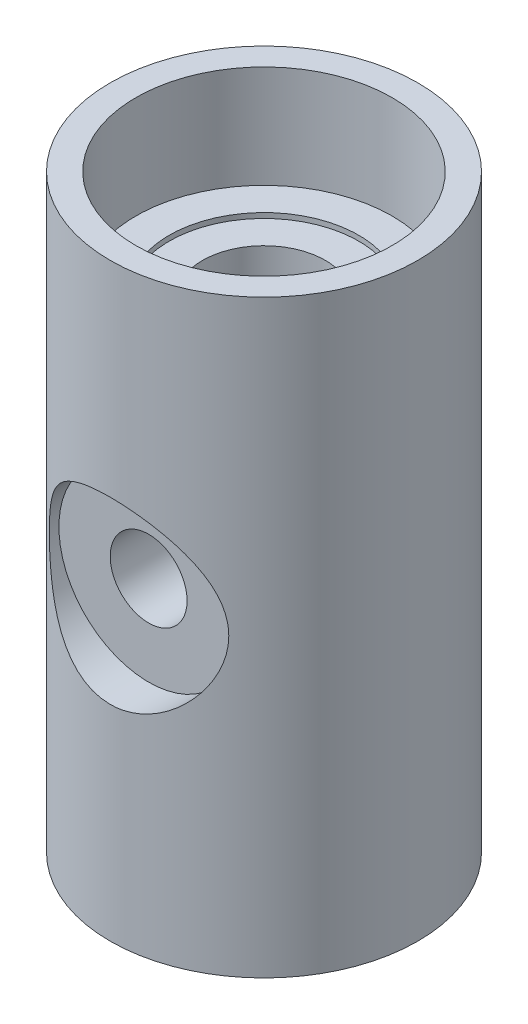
ISO-10303-21;
HEADER;
FILE_DESCRIPTION(('STEP AP214'),'2;1');
FILE_NAME('part.step','',(''),(''),'','','');
FILE_SCHEMA(('AUTOMOTIVE_DESIGN { 1 0 10303 214 1 1 1 1 }'));
ENDSEC;
DATA;
#1=APPLICATION_CONTEXT('core data for automotive mechanical design processes');
#2=APPLICATION_PROTOCOL_DEFINITION('international standard','automotive_design',2000,#1);
#3=PRODUCT_CONTEXT('',#1,'mechanical');
#4=PRODUCT('Part','Part','',(#3));
#5=PRODUCT_RELATED_PRODUCT_CATEGORY('part','',(#4));
#6=PRODUCT_DEFINITION_FORMATION('','',#4);
#7=PRODUCT_DEFINITION_CONTEXT('part definition',#1,'design');
#8=PRODUCT_DEFINITION('design','',#6,#7);
#9=PRODUCT_DEFINITION_SHAPE('','',#8);
#10=(LENGTH_UNIT() NAMED_UNIT(*) SI_UNIT(.MILLI.,.METRE.));
#11=(NAMED_UNIT(*) PLANE_ANGLE_UNIT() SI_UNIT($,.RADIAN.));
#12=(NAMED_UNIT(*) SI_UNIT($,.STERADIAN.) SOLID_ANGLE_UNIT());
#13=UNCERTAINTY_MEASURE_WITH_UNIT(LENGTH_MEASURE(1.E-05),#10,'distance_accuracy_value','');
#14=(GEOMETRIC_REPRESENTATION_CONTEXT(3) GLOBAL_UNCERTAINTY_ASSIGNED_CONTEXT((#13)) GLOBAL_UNIT_ASSIGNED_CONTEXT((#10,
#11,#12)) REPRESENTATION_CONTEXT('',''));
#15=CARTESIAN_POINT('',(0.,0.,0.));
#16=DIRECTION('',(0.,0.,1.));
#17=DIRECTION('',(1.,0.,0.));
#18=AXIS2_PLACEMENT_3D('',#15,#16,#17);
#19=CARTESIAN_POINT('',(0.,0.,0.800000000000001));
#20=DIRECTION('',(0.,0.,1.));
#21=DIRECTION('',(1.,0.,0.));
#22=AXIS2_PLACEMENT_3D('',#19,#20,#21);
#23=CYLINDRICAL_SURFACE('',#22,1.5);
#24=CARTESIAN_POINT('',(0.,-1.5,2.4));
#25=CARTESIAN_POINT('',(0.0762125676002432,-1.49999478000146,2.39999514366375));
#26=CARTESIAN_POINT('',(0.152515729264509,-1.49415238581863,2.39633187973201));
#27=CARTESIAN_POINT('',(0.302781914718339,-1.4710970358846,2.38202601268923));
#28=CARTESIAN_POINT('',(0.376740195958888,-1.45386240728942,2.37137010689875));
#29=CARTESIAN_POINT('',(0.519846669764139,-1.40902636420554,2.34415023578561));
#30=CARTESIAN_POINT('',(0.589016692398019,-1.38147625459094,2.32761552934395));
#31=CARTESIAN_POINT('',(0.721512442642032,-1.3171369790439,2.29001518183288));
#32=CARTESIAN_POINT('',(0.784838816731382,-1.28034883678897,2.26895004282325));
#33=CARTESIAN_POINT('',(0.909569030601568,-1.19533611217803,2.22204183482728));
#34=CARTESIAN_POINT('',(0.970415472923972,-1.14643284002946,2.1959515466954));
#35=CARTESIAN_POINT('',(1.08358365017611,-1.04013699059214,2.14237619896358));
#36=CARTESIAN_POINT('',(1.13589372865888,-0.982733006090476,2.11488929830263));
#37=CARTESIAN_POINT('',(1.23771447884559,-0.851959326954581,2.05716502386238));
#38=CARTESIAN_POINT('',(1.28588647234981,-0.777480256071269,2.02705933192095));
#39=CARTESIAN_POINT('',(1.36888759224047,-0.619722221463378,1.97196237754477));
#40=CARTESIAN_POINT('',(1.40373925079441,-0.536458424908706,1.94696251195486));
#41=CARTESIAN_POINT('',(1.45120080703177,-0.38542737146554,1.91171490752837));
#42=CARTESIAN_POINT('',(1.46723462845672,-0.319239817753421,1.89932287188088));
#43=CARTESIAN_POINT('',(1.49018212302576,-0.184432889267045,1.88137628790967));
#44=CARTESIAN_POINT('',(1.49710867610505,-0.115817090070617,1.87581208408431));
#45=CARTESIAN_POINT('',(1.50142701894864,0.0220956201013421,1.87235862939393));
#46=CARTESIAN_POINT('',(1.49879380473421,0.0913938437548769,1.87448950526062));
#47=CARTESIAN_POINT('',(1.48411580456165,0.228372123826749,1.88612882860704));
#48=CARTESIAN_POINT('',(1.47206347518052,0.296050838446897,1.89564318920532));
#49=CARTESIAN_POINT('',(1.43961724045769,0.426526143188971,1.92039087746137));
#50=CARTESIAN_POINT('',(1.41942020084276,0.489398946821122,1.93548858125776));
#51=CARTESIAN_POINT('',(1.37148227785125,0.610993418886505,1.96974679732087));
#52=CARTESIAN_POINT('',(1.34373872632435,0.669713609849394,1.98890874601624));
#53=CARTESIAN_POINT('',(1.27553871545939,0.792999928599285,2.03345779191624));
#54=CARTESIAN_POINT('',(1.23367555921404,0.856608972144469,2.05933909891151));
#55=CARTESIAN_POINT('',(1.14105775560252,0.976596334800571,2.11206854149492));
#56=CARTESIAN_POINT('',(1.09029396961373,1.03296711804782,2.13891764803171));
#57=CARTESIAN_POINT('',(0.971423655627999,1.14636209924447,2.19575873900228));
#58=CARTESIAN_POINT('',(0.901837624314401,1.2019595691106,2.22553838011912));
#59=CARTESIAN_POINT('',(0.752577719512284,1.3006210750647,2.28033666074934));
#60=CARTESIAN_POINT('',(0.6729078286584,1.34369003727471,2.30535717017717));
#61=CARTESIAN_POINT('',(0.509860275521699,1.41331642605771,2.34664047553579));
#62=CARTESIAN_POINT('',(0.426916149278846,1.44064084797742,2.36330371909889));
#63=CARTESIAN_POINT('',(0.256334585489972,1.48051791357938,2.38781915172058));
#64=CARTESIAN_POINT('',(0.168703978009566,1.4930914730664,2.39568381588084));
#65=CARTESIAN_POINT('',(0.00541874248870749,1.50187902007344,2.40117408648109));
#66=CARTESIAN_POINT('',(-0.0700833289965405,1.50024381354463,2.40014593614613));
#67=CARTESIAN_POINT('',(-0.21956654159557,1.48574060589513,2.39110681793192));
#68=CARTESIAN_POINT('',(-0.293547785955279,1.4728733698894,2.3830963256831));
#69=CARTESIAN_POINT('',(-0.435025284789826,1.43731375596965,2.36128862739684));
#70=CARTESIAN_POINT('',(-0.502662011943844,1.41502541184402,2.34773004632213));
#71=CARTESIAN_POINT('',(-0.633165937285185,1.36164433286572,2.31594820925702));
#72=CARTESIAN_POINT('',(-0.696032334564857,1.33055012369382,2.2977241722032));
#73=CARTESIAN_POINT('',(-0.822100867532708,1.25698175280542,2.255880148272));
#74=CARTESIAN_POINT('',(-0.884696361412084,1.21367571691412,2.23190117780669));
#75=CARTESIAN_POINT('',(-1.00217116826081,1.11864736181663,2.1816836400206));
#76=CARTESIAN_POINT('',(-1.05704178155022,1.06691569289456,2.15544257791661));
#77=CARTESIAN_POINT('',(-1.16576903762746,0.94783795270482,2.0988704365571));
#78=CARTESIAN_POINT('',(-1.21832222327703,0.879315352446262,2.06849860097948));
#79=CARTESIAN_POINT('',(-1.31136422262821,0.733349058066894,2.01080115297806));
#80=CARTESIAN_POINT('',(-1.35186138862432,0.655911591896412,1.98347343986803));
#81=CARTESIAN_POINT('',(-1.41221726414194,0.510369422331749,1.9408023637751));
#82=CARTESIAN_POINT('',(-1.43462275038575,0.443711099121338,1.92414763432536));
#83=CARTESIAN_POINT('',(-1.47000129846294,0.3067282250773,1.89726036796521));
#84=CARTESIAN_POINT('',(-1.48298909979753,0.236409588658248,1.88701779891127));
#85=CARTESIAN_POINT('',(-1.49881660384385,0.0934916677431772,1.87447589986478));
#86=CARTESIAN_POINT('',(-1.50159824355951,0.020881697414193,1.87222202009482));
#87=CARTESIAN_POINT('',(-1.49663734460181,-0.123757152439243,1.87618875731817));
#88=CARTESIAN_POINT('',(-1.48889130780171,-0.195785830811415,1.88241219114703));
#89=CARTESIAN_POINT('',(-1.46445926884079,-0.331235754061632,1.90146466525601));
#90=CARTESIAN_POINT('',(-1.44854303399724,-0.394883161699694,1.91372169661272));
#91=CARTESIAN_POINT('',(-1.40901148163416,-0.518562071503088,1.94301036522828));
#92=CARTESIAN_POINT('',(-1.38539295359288,-0.578592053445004,1.96004399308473));
#93=CARTESIAN_POINT('',(-1.32723228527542,-0.702716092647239,1.99996683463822));
#94=CARTESIAN_POINT('',(-1.29160373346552,-0.766140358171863,2.02334676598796));
#95=CARTESIAN_POINT('',(-1.21200020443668,-0.886726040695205,2.07201247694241));
#96=CARTESIAN_POINT('',(-1.16801847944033,-0.943882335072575,2.0972997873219));
#97=CARTESIAN_POINT('',(-1.06280426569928,-1.06201710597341,2.15282292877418));
#98=CARTESIAN_POINT('',(-0.999880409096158,-1.12150901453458,2.18304650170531));
#99=CARTESIAN_POINT('',(-0.86378693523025,-1.22939379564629,2.24038474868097));
#100=CARTESIAN_POINT('',(-0.790611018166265,-1.27777979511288,2.26749749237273));
#101=CARTESIAN_POINT('',(-0.635226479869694,-1.36172535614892,2.31584053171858));
#102=CARTESIAN_POINT('',(-0.553002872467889,-1.39726320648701,2.33706085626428));
#103=CARTESIAN_POINT('',(-0.382073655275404,-1.45328626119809,2.37097825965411));
#104=CARTESIAN_POINT('',(-0.293392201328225,-1.47382468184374,2.38370545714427));
#105=CARTESIAN_POINT('',(-0.169702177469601,-1.49075905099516,2.39423366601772));
#106=CARTESIAN_POINT('',(-0.135898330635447,-1.49421823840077,2.39639006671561));
#107=CARTESIAN_POINT('',(-0.0680690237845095,-1.49883994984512,2.39927436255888));
#108=CARTESIAN_POINT('',(-0.0340435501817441,-1.50000233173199,2.40000216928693));
#109=CARTESIAN_POINT('',(0.,-1.5,2.4));
#110=B_SPLINE_CURVE_WITH_KNOTS('',3,(#24,#25,#26,#27,#28,#29,#30,#31,#32,#33,#34,#35,#36,#37,
#38,#39,#40,#41,#42,#43,#44,#45,#46,#47,#48,#49,#50,#51,#52,#53,#54,#55,#56,#57,#58,#59,#60,#61,
#62,#63,#64,#65,#66,#67,#68,#69,#70,#71,#72,#73,#74,#75,#76,#77,#78,#79,#80,#81,#82,#83,#84,#85,
#86,#87,#88,#89,#90,#91,#92,#93,#94,#95,#96,#97,#98,#99,#100,#101,#102,#103,#104,#105,#106,#107,
#108,#109),.UNSPECIFIED.,.T.,.F.,(4,2,2,2,2,2,2,2,2,2,2,2,2,2,2,2,2,2,2,2,2,2,2,2,2,2,2,2,2,2,2,
2,2,2,2,2,2,2,2,2,2,2,4),(0.,0.228494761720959,0.457425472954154,0.685232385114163,
0.913014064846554,1.15898624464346,1.40529153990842,1.68495571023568,1.96414469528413,
2.1709441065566,2.37745073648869,2.58449788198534,2.791711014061,2.99419007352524,
3.1967408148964,3.43712940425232,3.67776627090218,3.95810616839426,4.23833568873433,
4.50341008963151,4.76810817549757,4.99352616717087,5.21892880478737,5.43551405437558,
5.6521355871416,5.89062277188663,6.12937642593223,6.40278850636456,6.67601072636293,
6.89195928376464,7.10756912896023,7.32440369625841,7.54131033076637,7.74075802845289,
7.94028896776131,8.16870627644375,8.39730889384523,8.67120646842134,8.945273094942,
9.21980070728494,9.4933495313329,9.59541001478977,9.69747681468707),.UNSPECIFIED.);
#111=CARTESIAN_POINT('',(0.,-1.5,2.4));
#112=VERTEX_POINT('',#111);
#113=EDGE_CURVE('E66',#112,#112,#110,.T.);
#114=ORIENTED_EDGE('',*,*,#113,.F.);
#115=EDGE_LOOP('',(#114));
#116=FACE_BOUND('',#115,.T.);
#117=CARTESIAN_POINT('',(0.,0.,4.5));
#118=DIRECTION('',(0.,0.,1.));
#119=DIRECTION('',(1.,0.,0.));
#120=AXIS2_PLACEMENT_3D('',#117,#118,#119);
#121=CIRCLE('',#120,1.5);
#122=CARTESIAN_POINT('',(1.5,0.,4.5));
#123=VERTEX_POINT('',#122);
#124=EDGE_CURVE('E64',#123,#123,#121,.F.);
#125=ORIENTED_EDGE('',*,*,#124,.F.);
#126=EDGE_LOOP('',(#125));
#127=FACE_BOUND('',#126,.T.);
#128=ADVANCED_FACE('F30',(#116,#127),#23,.F.);
#129=CARTESIAN_POINT('',(0.,-11.5,0.));
#130=DIRECTION('',(0.,1.,0.));
#131=DIRECTION('',(0.,0.,1.));
#132=AXIS2_PLACEMENT_3D('',#129,#130,#131);
#133=CYLINDRICAL_SURFACE('',#132,2.4);
#134=ORIENTED_EDGE('',*,*,#113,.T.);
#135=EDGE_LOOP('',(#134));
#136=FACE_BOUND('',#135,.T.);
#137=CARTESIAN_POINT('',(0.,7.3,0.));
#138=DIRECTION('',(0.,1.,0.));
#139=DIRECTION('',(0.,0.,1.));
#140=AXIS2_PLACEMENT_3D('',#137,#138,#139);
#141=CIRCLE('',#140,2.4);
#142=CARTESIAN_POINT('',(0.,7.3,2.4));
#143=VERTEX_POINT('',#142);
#144=EDGE_CURVE('E56',#143,#143,#141,.F.);
#145=ORIENTED_EDGE('',*,*,#144,.F.);
#146=EDGE_LOOP('',(#145));
#147=FACE_BOUND('',#146,.T.);
#148=CARTESIAN_POINT('',(0.,-7.3,0.));
#149=DIRECTION('',(0.,-1.,0.));
#150=DIRECTION('',(0.,0.,-1.));
#151=AXIS2_PLACEMENT_3D('',#148,#149,#150);
#152=CIRCLE('',#151,2.4);
#153=CARTESIAN_POINT('',(0.,-7.3,-2.4));
#154=VERTEX_POINT('',#153);
#155=EDGE_CURVE('E60',#154,#154,#152,.F.);
#156=ORIENTED_EDGE('',*,*,#155,.F.);
#157=EDGE_LOOP('',(#156));
#158=FACE_BOUND('',#157,.T.);
#159=ADVANCED_FACE('F83',(#136,#147,#158),#133,.F.);
#160=CARTESIAN_POINT('',(0.,-7.5,0.));
#161=DIRECTION('',(0.,-1.,0.));
#162=DIRECTION('',(0.,0.,1.));
#163=AXIS2_PLACEMENT_3D('',#160,#161,#162);
#164=PLANE('',#163);
#165=CARTESIAN_POINT('',(0.,-7.5,0.));
#166=DIRECTION('',(0.,1.,0.));
#167=DIRECTION('',(0.,0.,1.));
#168=AXIS2_PLACEMENT_3D('',#165,#166,#167);
#169=CIRCLE('',#168,5.);
#170=CARTESIAN_POINT('',(0.,-7.5,5.));
#171=VERTEX_POINT('',#170);
#172=EDGE_CURVE('E139',#171,#171,#169,.T.);
#173=ORIENTED_EDGE('',*,*,#172,.F.);
#174=EDGE_LOOP('',(#173));
#175=FACE_BOUND('',#174,.T.);
#176=CARTESIAN_POINT('',(0.,-7.5,0.));
#177=DIRECTION('',(0.,1.,0.));
#178=DIRECTION('',(0.,0.,1.));
#179=AXIS2_PLACEMENT_3D('',#176,#177,#178);
#180=CIRCLE('',#179,3.7);
#181=CARTESIAN_POINT('',(0.,-7.5,3.7));
#182=VERTEX_POINT('',#181);
#183=EDGE_CURVE('E71',#182,#182,#180,.T.);
#184=ORIENTED_EDGE('',*,*,#183,.T.);
#185=EDGE_LOOP('',(#184));
#186=FACE_BOUND('',#185,.T.);
#187=ADVANCED_FACE('F103',(#175,#186),#164,.T.);
#188=CARTESIAN_POINT('',(0.,-11.5,0.));
#189=DIRECTION('',(0.,1.,0.));
#190=DIRECTION('',(0.,0.,1.));
#191=AXIS2_PLACEMENT_3D('',#188,#189,#190);
#192=PLANE('',#191);
#193=CARTESIAN_POINT('',(0.,-11.5,0.));
#194=DIRECTION('',(0.,1.,0.));
#195=DIRECTION('',(0.,0.,1.));
#196=AXIS2_PLACEMENT_3D('',#193,#194,#195);
#197=CIRCLE('',#196,6.);
#198=CARTESIAN_POINT('',(0.,-11.5,6.));
#199=VERTEX_POINT('',#198);
#200=EDGE_CURVE('E45',#199,#199,#197,.T.);
#201=ORIENTED_EDGE('',*,*,#200,.F.);
#202=EDGE_LOOP('',(#201));
#203=FACE_BOUND('',#202,.T.);
#204=CARTESIAN_POINT('',(0.,-11.5,0.));
#205=DIRECTION('',(0.,1.,0.));
#206=DIRECTION('',(0.,0.,1.));
#207=AXIS2_PLACEMENT_3D('',#204,#205,#206);
#208=CIRCLE('',#207,5.);
#209=CARTESIAN_POINT('',(0.,-11.5,5.));
#210=VERTEX_POINT('',#209);
#211=EDGE_CURVE('E62',#210,#210,#208,.T.);
#212=ORIENTED_EDGE('',*,*,#211,.T.);
#213=EDGE_LOOP('',(#212));
#214=FACE_BOUND('',#213,.T.);
#215=ADVANCED_FACE('F106',(#203,#214),#192,.F.);
#216=CARTESIAN_POINT('',(0.,11.5,0.));
#217=DIRECTION('',(0.,-1.,0.));
#218=DIRECTION('',(0.,0.,-1.));
#219=AXIS2_PLACEMENT_3D('',#216,#217,#218);
#220=CYLINDRICAL_SURFACE('',#219,6.);
#221=CARTESIAN_POINT('',(3.5,0.,4.87339717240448));
#222=CARTESIAN_POINT('',(3.50000093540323,-0.177277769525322,4.87339641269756));
#223=CARTESIAN_POINT('',(3.48644793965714,-0.354552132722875,4.88321573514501));
#224=CARTESIAN_POINT('',(3.43317065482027,-0.703218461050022,4.9208078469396));
#225=CARTESIAN_POINT('',(3.39341938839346,-0.874604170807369,4.94859914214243));
#226=CARTESIAN_POINT('',(3.29030409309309,-1.20574223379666,5.01773625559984));
#227=CARTESIAN_POINT('',(3.22710003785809,-1.36556483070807,5.05899002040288));
#228=CARTESIAN_POINT('',(3.07937386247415,-1.67226119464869,5.1502404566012));
#229=CARTESIAN_POINT('',(2.99484491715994,-1.81913079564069,5.20023992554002));
#230=CARTESIAN_POINT('',(2.79556649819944,-2.11425376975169,5.31029228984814));
#231=CARTESIAN_POINT('',(2.67846102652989,-2.2607283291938,5.3708402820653));
#232=CARTESIAN_POINT('',(2.42208832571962,-2.53347611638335,5.49122196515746));
#233=CARTESIAN_POINT('',(2.28280589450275,-2.65973536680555,5.55105513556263));
#234=CARTESIAN_POINT('',(2.05148630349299,-2.83763163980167,5.63907450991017));
#235=CARTESIAN_POINT('',(1.96633387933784,-2.89731089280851,5.66940255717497));
#236=CARTESIAN_POINT('',(1.79041458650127,-3.00919746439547,5.72738826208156));
#237=CARTESIAN_POINT('',(1.69965023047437,-3.06140809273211,5.75504710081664));
#238=CARTESIAN_POINT('',(1.51302950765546,-3.15781122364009,5.80690294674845));
#239=CARTESIAN_POINT('',(1.41717390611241,-3.20200492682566,5.83110047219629));
#240=CARTESIAN_POINT('',(1.22107302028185,-3.28179435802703,5.87529321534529));
#241=CARTESIAN_POINT('',(1.12083060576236,-3.31739561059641,5.89529113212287));
#242=CARTESIAN_POINT('',(0.926016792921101,-3.37666962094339,5.92885804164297));
#243=CARTESIAN_POINT('',(0.831757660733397,-3.40113228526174,5.94284606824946));
#244=CARTESIAN_POINT('',(0.641044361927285,-3.44217497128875,5.96642990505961));
#245=CARTESIAN_POINT('',(0.544591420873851,-3.45875928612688,5.97602810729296));
#246=CARTESIAN_POINT('',(0.350333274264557,-3.48379858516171,5.99055493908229));
#247=CARTESIAN_POINT('',(0.252528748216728,-3.49225751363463,5.99548583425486));
#248=CARTESIAN_POINT('',(0.0564358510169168,-3.50092065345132,6.0005360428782));
#249=CARTESIAN_POINT('',(-0.0418524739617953,-3.50112563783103,6.00065580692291));
#250=CARTESIAN_POINT('',(-0.226429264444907,-3.49374095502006,5.99635041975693));
#251=CARTESIAN_POINT('',(-0.312767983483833,-3.48706623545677,5.99245875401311));
#252=CARTESIAN_POINT('',(-0.484485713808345,-3.46738460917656,5.98102806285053));
#253=CARTESIAN_POINT('',(-0.569864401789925,-3.45437563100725,5.97348784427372));
#254=CARTESIAN_POINT('',(-0.823592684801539,-3.40606182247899,5.94563085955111));
#255=CARTESIAN_POINT('',(-0.989708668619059,-3.36146277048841,5.92007321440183));
#256=CARTESIAN_POINT('',(-1.31275590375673,-3.24903340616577,5.85696630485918));
#257=CARTESIAN_POINT('',(-1.46960684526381,-3.18102735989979,5.81932647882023));
#258=CARTESIAN_POINT('',(-1.76992855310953,-3.02424543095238,5.73512765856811));
#259=CARTESIAN_POINT('',(-1.9133955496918,-2.93546372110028,5.68856616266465));
#260=CARTESIAN_POINT('',(-2.20064206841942,-2.7280222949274,5.58418743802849));
#261=CARTESIAN_POINT('',(-2.34253411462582,-2.60709328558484,5.52569117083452));
#262=CARTESIAN_POINT('',(-2.60519777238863,-2.34466895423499,5.40682680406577));
#263=CARTESIAN_POINT('',(-2.72594205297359,-2.20314744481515,5.34645639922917));
#264=CARTESIAN_POINT('',(-2.95579694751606,-1.88564649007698,5.22321767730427));
#265=CARTESIAN_POINT('',(-3.06230599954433,-1.70760325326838,5.16076614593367));
#266=CARTESIAN_POINT('',(-3.24322331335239,-1.33218303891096,5.04904774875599));
#267=CARTESIAN_POINT('',(-3.31768964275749,-1.13484183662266,4.99975709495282));
#268=CARTESIAN_POINT('',(-3.4170744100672,-0.774468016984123,4.93217164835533));
#269=CARTESIAN_POINT('',(-3.4495501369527,-0.614376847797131,4.9093009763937));
#270=CARTESIAN_POINT('',(-3.49180426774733,-0.289835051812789,4.8793454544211));
#271=CARTESIAN_POINT('',(-3.50160627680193,-0.125389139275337,4.87224418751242));
#272=CARTESIAN_POINT('',(-3.49796077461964,0.203242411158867,4.87486107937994));
#273=CARTESIAN_POINT('',(-3.48449247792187,0.367427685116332,4.88459427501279));
#274=CARTESIAN_POINT('',(-3.43506780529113,0.690724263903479,4.91947046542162));
#275=CARTESIAN_POINT('',(-3.39909443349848,0.849831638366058,4.94462510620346));
#276=CARTESIAN_POINT('',(-3.30605842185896,1.16037405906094,5.00730560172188));
#277=CARTESIAN_POINT('',(-3.24884499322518,1.31174522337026,5.04491969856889));
#278=CARTESIAN_POINT('',(-3.11531442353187,1.60329764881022,5.12845117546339));
#279=CARTESIAN_POINT('',(-3.03898973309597,1.74347445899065,5.17437183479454));
#280=CARTESIAN_POINT('',(-2.85419501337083,2.03423875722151,5.27888825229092));
#281=CARTESIAN_POINT('',(-2.74245197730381,2.18245699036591,5.3383045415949));
#282=CARTESIAN_POINT('',(-2.49705487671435,2.45947881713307,5.45741535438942));
#283=CARTESIAN_POINT('',(-2.36338142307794,2.58826503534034,5.51711007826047));
#284=CARTESIAN_POINT('',(-2.05974314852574,2.8372649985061,5.63798921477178));
#285=CARTESIAN_POINT('',(-1.88739139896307,2.95490844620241,5.69859334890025));
#286=CARTESIAN_POINT('',(-1.61316991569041,3.1078416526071,5.77986541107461));
#287=CARTESIAN_POINT('',(-1.51911093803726,3.15490991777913,5.80535774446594));
#288=CARTESIAN_POINT('',(-1.3263294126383,3.24067209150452,5.85240658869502));
#289=CARTESIAN_POINT('',(-1.22760983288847,3.27937124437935,5.87396556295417));
#290=CARTESIAN_POINT('',(-1.03411285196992,3.34517993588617,5.91096859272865));
#291=CARTESIAN_POINT('',(-0.939628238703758,3.37295785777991,5.92675836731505));
#292=CARTESIAN_POINT('',(-0.748099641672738,3.42053716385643,5.95396444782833));
#293=CARTESIAN_POINT('',(-0.651057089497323,3.44034291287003,5.96538314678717));
#294=CARTESIAN_POINT('',(-0.45526451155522,3.47167940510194,5.983510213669));
#295=CARTESIAN_POINT('',(-0.356515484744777,3.48321483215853,5.99022124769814));
#296=CARTESIAN_POINT('',(-0.1581886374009,3.49783664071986,5.99873532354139));
#297=CARTESIAN_POINT('',(-0.0586109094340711,3.5009239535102,6.00053890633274));
#298=CARTESIAN_POINT('',(0.128080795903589,3.49874218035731,5.99926633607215));
#299=CARTESIAN_POINT('',(0.215211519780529,3.49446035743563,5.99676668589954));
#300=CARTESIAN_POINT('',(0.388733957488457,3.47943739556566,5.98802575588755));
#301=CARTESIAN_POINT('',(0.475125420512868,3.46869414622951,5.98178325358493));
#302=CARTESIAN_POINT('',(0.732176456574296,3.42694664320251,5.95763431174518));
#303=CARTESIAN_POINT('',(0.900898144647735,3.38642210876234,5.93430474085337));
#304=CARTESIAN_POINT('',(1.22754952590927,3.28213924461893,5.87542473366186));
#305=CARTESIAN_POINT('',(1.38553112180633,3.21850373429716,5.83993895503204));
#306=CARTESIAN_POINT('',(1.68873020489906,3.0702892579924,5.75958333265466));
#307=CARTESIAN_POINT('',(1.83394447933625,2.98570504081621,5.71471113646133));
#308=CARTESIAN_POINT('',(2.12460251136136,2.78753012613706,5.61357922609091));
#309=CARTESIAN_POINT('',(2.26832013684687,2.67177406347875,5.55661011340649));
#310=CARTESIAN_POINT('',(2.5354448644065,2.41977205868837,5.43992761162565));
#311=CARTESIAN_POINT('',(2.65882769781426,2.28350199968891,5.38021105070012));
#312=CARTESIAN_POINT('',(2.89610435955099,1.97597820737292,5.2566556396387));
#313=CARTESIAN_POINT('',(3.00730729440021,1.80250671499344,5.19312435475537));
#314=CARTESIAN_POINT('',(3.19864331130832,1.43573005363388,5.07752201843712));
#315=CARTESIAN_POINT('',(3.27881457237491,1.24244962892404,5.0254369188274));
#316=CARTESIAN_POINT('',(3.3932696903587,0.87524079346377,4.94870191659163));
#317=CARTESIAN_POINT('',(3.43307983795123,0.703715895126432,4.92087121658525));
#318=CARTESIAN_POINT('',(3.48642673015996,0.354787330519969,4.88323142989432));
#319=CARTESIAN_POINT('',(3.49999906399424,0.177391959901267,4.87339793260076));
#320=CARTESIAN_POINT('',(3.5,0.,4.87339717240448));
#321=B_SPLINE_CURVE_WITH_KNOTS('',3,(#221,#222,#223,#224,#225,#226,#227,#228,#229,#230,#231,
#232,#233,#234,#235,#236,#237,#238,#239,#240,#241,#242,#243,#244,#245,#246,#247,#248,#249,#250,
#251,#252,#253,#254,#255,#256,#257,#258,#259,#260,#261,#262,#263,#264,#265,#266,#267,#268,#269,
#270,#271,#272,#273,#274,#275,#276,#277,#278,#279,#280,#281,#282,#283,#284,#285,#286,#287,#288,
#289,#290,#291,#292,#293,#294,#295,#296,#297,#298,#299,#300,#301,#302,#303,#304,#305,#306,#307,
#308,#309,#310,#311,#312,#313,#314,#315,#316,#317,#318,#319,#320),.UNSPECIFIED.,.T.,.F.,(4,2,2,
2,2,2,2,2,2,2,2,2,2,2,2,2,2,2,2,2,2,2,2,2,2,2,2,2,2,2,2,2,2,2,2,2,2,2,2,2,2,2,2,2,2,2,2,2,2,4),
(0.,0.531090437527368,1.06272861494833,1.59080517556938,2.1190509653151,2.70797318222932,
3.29730085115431,3.62188124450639,3.94631734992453,4.27070482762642,4.59488318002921,
4.88960721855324,5.18417046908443,5.4785906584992,5.77298327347,6.03271231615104,
6.29252635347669,6.81163795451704,7.33473514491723,7.85797923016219,8.44181220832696,
9.02639424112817,9.67312565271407,10.3186800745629,10.8113676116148,11.3035419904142,
11.7961562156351,12.2891429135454,12.7856985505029,13.2824506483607,13.8648133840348,
14.4476938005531,15.0957740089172,15.4200443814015,15.7441109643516,16.0429097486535,
16.3415447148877,16.6400104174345,16.9384432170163,17.1999277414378,17.461497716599,
17.9840884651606,18.5039416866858,19.023925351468,19.6010134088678,20.1787852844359,
20.822510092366,21.4654403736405,21.9975952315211,22.5290277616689),.UNSPECIFIED.);
#322=CARTESIAN_POINT('',(3.5,0.,4.87339717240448));
#323=VERTEX_POINT('',#322);
#324=EDGE_CURVE('E10',#323,#323,#321,.T.);
#325=ORIENTED_EDGE('',*,*,#324,.T.);
#326=EDGE_LOOP('',(#325));
#327=FACE_BOUND('',#326,.T.);
#328=CARTESIAN_POINT('',(0.,11.5,0.));
#329=DIRECTION('',(0.,1.,0.));
#330=DIRECTION('',(0.,0.,1.));
#331=AXIS2_PLACEMENT_3D('',#328,#329,#330);
#332=CIRCLE('',#331,6.);
#333=CARTESIAN_POINT('',(0.,11.5,6.));
#334=VERTEX_POINT('',#333);
#335=EDGE_CURVE('E41',#334,#334,#332,.T.);
#336=ORIENTED_EDGE('',*,*,#335,.F.);
#337=EDGE_LOOP('',(#336));
#338=FACE_BOUND('',#337,.T.);
#339=ORIENTED_EDGE('',*,*,#200,.T.);
#340=EDGE_LOOP('',(#339));
#341=FACE_BOUND('',#340,.T.);
#342=ADVANCED_FACE('F32',(#327,#338,#341),#220,.T.);
#343=CARTESIAN_POINT('',(0.,11.5,0.));
#344=DIRECTION('',(0.,1.,0.));
#345=DIRECTION('',(0.,0.,1.));
#346=AXIS2_PLACEMENT_3D('',#343,#344,#345);
#347=PLANE('',#346);
#348=CARTESIAN_POINT('',(0.,11.5,0.));
#349=DIRECTION('',(0.,1.,0.));
#350=DIRECTION('',(0.,0.,1.));
#351=AXIS2_PLACEMENT_3D('',#348,#349,#350);
#352=CIRCLE('',#351,5.);
#353=CARTESIAN_POINT('',(0.,11.5,5.));
#354=VERTEX_POINT('',#353);
#355=EDGE_CURVE('E53',#354,#354,#352,.T.);
#356=ORIENTED_EDGE('',*,*,#355,.F.);
#357=EDGE_LOOP('',(#356));
#358=FACE_BOUND('',#357,.T.);
#359=ORIENTED_EDGE('',*,*,#335,.T.);
#360=EDGE_LOOP('',(#359));
#361=FACE_BOUND('',#360,.T.);
#362=ADVANCED_FACE('F122',(#358,#361),#347,.T.);
#363=CARTESIAN_POINT('',(0.,7.5,0.));
#364=DIRECTION('',(0.,1.,0.));
#365=DIRECTION('',(0.,0.,1.));
#366=AXIS2_PLACEMENT_3D('',#363,#364,#365);
#367=PLANE('',#366);
#368=CARTESIAN_POINT('',(0.,7.5,0.));
#369=DIRECTION('',(0.,1.,0.));
#370=DIRECTION('',(0.,0.,1.));
#371=AXIS2_PLACEMENT_3D('',#368,#369,#370);
#372=CIRCLE('',#371,3.7);
#373=CARTESIAN_POINT('',(0.,7.5,3.7));
#374=VERTEX_POINT('',#373);
#375=EDGE_CURVE('E136',#374,#374,#372,.T.);
#376=ORIENTED_EDGE('',*,*,#375,.F.);
#377=EDGE_LOOP('',(#376));
#378=FACE_BOUND('',#377,.T.);
#379=CARTESIAN_POINT('',(0.,7.5,0.));
#380=DIRECTION('',(0.,1.,0.));
#381=DIRECTION('',(0.,0.,1.));
#382=AXIS2_PLACEMENT_3D('',#379,#380,#381);
#383=CIRCLE('',#382,5.);
#384=CARTESIAN_POINT('',(0.,7.5,5.));
#385=VERTEX_POINT('',#384);
#386=EDGE_CURVE('E50',#385,#385,#383,.T.);
#387=ORIENTED_EDGE('',*,*,#386,.T.);
#388=EDGE_LOOP('',(#387));
#389=FACE_BOUND('',#388,.T.);
#390=ADVANCED_FACE('F120',(#378,#389),#367,.T.);
#391=CARTESIAN_POINT('',(0.,7.5,0.));
#392=DIRECTION('',(0.,1.,0.));
#393=DIRECTION('',(0.,0.,1.));
#394=AXIS2_PLACEMENT_3D('',#391,#392,#393);
#395=CYLINDRICAL_SURFACE('',#394,5.);
#396=ORIENTED_EDGE('',*,*,#386,.F.);
#397=EDGE_LOOP('',(#396));
#398=FACE_BOUND('',#397,.T.);
#399=ORIENTED_EDGE('',*,*,#355,.T.);
#400=EDGE_LOOP('',(#399));
#401=FACE_BOUND('',#400,.T.);
#402=ADVANCED_FACE('F115',(#398,#401),#395,.F.);
#403=CARTESIAN_POINT('',(0.,7.3,0.));
#404=DIRECTION('',(0.,1.,0.));
#405=DIRECTION('',(0.,0.,1.));
#406=AXIS2_PLACEMENT_3D('',#403,#404,#405);
#407=PLANE('',#406);
#408=CARTESIAN_POINT('',(0.,7.3,0.));
#409=DIRECTION('',(0.,1.,0.));
#410=DIRECTION('',(0.,0.,1.));
#411=AXIS2_PLACEMENT_3D('',#408,#409,#410);
#412=CIRCLE('',#411,3.7);
#413=CARTESIAN_POINT('',(0.,7.3,3.7));
#414=VERTEX_POINT('',#413);
#415=EDGE_CURVE('E59',#414,#414,#412,.T.);
#416=ORIENTED_EDGE('',*,*,#415,.T.);
#417=EDGE_LOOP('',(#416));
#418=FACE_BOUND('',#417,.T.);
#419=ORIENTED_EDGE('',*,*,#144,.T.);
#420=EDGE_LOOP('',(#419));
#421=FACE_BOUND('',#420,.T.);
#422=ADVANCED_FACE('F112',(#418,#421),#407,.T.);
#423=CARTESIAN_POINT('',(0.,7.3,0.));
#424=DIRECTION('',(0.,1.,0.));
#425=DIRECTION('',(0.,0.,1.));
#426=AXIS2_PLACEMENT_3D('',#423,#424,#425);
#427=CYLINDRICAL_SURFACE('',#426,3.7);
#428=ORIENTED_EDGE('',*,*,#415,.F.);
#429=EDGE_LOOP('',(#428));
#430=FACE_BOUND('',#429,.T.);
#431=ORIENTED_EDGE('',*,*,#375,.T.);
#432=EDGE_LOOP('',(#431));
#433=FACE_BOUND('',#432,.T.);
#434=ADVANCED_FACE('F110',(#430,#433),#427,.F.);
#435=CARTESIAN_POINT('',(0.,-7.5,0.));
#436=DIRECTION('',(0.,-1.,0.));
#437=DIRECTION('',(0.,0.,-1.));
#438=AXIS2_PLACEMENT_3D('',#435,#436,#437);
#439=CYLINDRICAL_SURFACE('',#438,5.);
#440=ORIENTED_EDGE('',*,*,#172,.T.);
#441=EDGE_LOOP('',(#440));
#442=FACE_BOUND('',#441,.T.);
#443=ORIENTED_EDGE('',*,*,#211,.F.);
#444=EDGE_LOOP('',(#443));
#445=FACE_BOUND('',#444,.T.);
#446=ADVANCED_FACE('F98',(#442,#445),#439,.F.);
#447=CARTESIAN_POINT('',(0.,-7.3,0.));
#448=DIRECTION('',(0.,-1.,0.));
#449=DIRECTION('',(0.,0.,1.));
#450=AXIS2_PLACEMENT_3D('',#447,#448,#449);
#451=PLANE('',#450);
#452=CARTESIAN_POINT('',(0.,-7.3,0.));
#453=DIRECTION('',(0.,1.,0.));
#454=DIRECTION('',(0.,0.,1.));
#455=AXIS2_PLACEMENT_3D('',#452,#453,#454);
#456=CIRCLE('',#455,3.7);
#457=CARTESIAN_POINT('',(0.,-7.3,3.7));
#458=VERTEX_POINT('',#457);
#459=EDGE_CURVE('E63',#458,#458,#456,.T.);
#460=ORIENTED_EDGE('',*,*,#459,.F.);
#461=EDGE_LOOP('',(#460));
#462=FACE_BOUND('',#461,.T.);
#463=ORIENTED_EDGE('',*,*,#155,.T.);
#464=EDGE_LOOP('',(#463));
#465=FACE_BOUND('',#464,.T.);
#466=ADVANCED_FACE('F94',(#462,#465),#451,.T.);
#467=CARTESIAN_POINT('',(0.,-7.3,0.));
#468=DIRECTION('',(0.,-1.,0.));
#469=DIRECTION('',(0.,0.,-1.));
#470=AXIS2_PLACEMENT_3D('',#467,#468,#469);
#471=CYLINDRICAL_SURFACE('',#470,3.7);
#472=ORIENTED_EDGE('',*,*,#459,.T.);
#473=EDGE_LOOP('',(#472));
#474=FACE_BOUND('',#473,.T.);
#475=ORIENTED_EDGE('',*,*,#183,.F.);
#476=EDGE_LOOP('',(#475));
#477=FACE_BOUND('',#476,.T.);
#478=ADVANCED_FACE('F97',(#474,#477),#471,.F.);
#479=CARTESIAN_POINT('',(0.,0.,4.5));
#480=DIRECTION('',(0.,0.,1.));
#481=DIRECTION('',(1.,0.,0.));
#482=AXIS2_PLACEMENT_3D('',#479,#480,#481);
#483=CYLINDRICAL_SURFACE('',#482,3.5);
#484=CARTESIAN_POINT('',(0.,0.,4.5));
#485=DIRECTION('',(0.,0.,1.));
#486=DIRECTION('',(1.,0.,0.));
#487=AXIS2_PLACEMENT_3D('',#484,#485,#486);
#488=CIRCLE('',#487,3.5);
#489=CARTESIAN_POINT('',(3.5,0.,4.5));
#490=VERTEX_POINT('',#489);
#491=EDGE_CURVE('E67',#490,#490,#488,.T.);
#492=ORIENTED_EDGE('',*,*,#491,.F.);
#493=EDGE_LOOP('',(#492));
#494=FACE_BOUND('',#493,.T.);
#495=ORIENTED_EDGE('',*,*,#324,.F.);
#496=EDGE_LOOP('',(#495));
#497=FACE_BOUND('',#496,.T.);
#498=ADVANCED_FACE('F91',(#494,#497),#483,.F.);
#499=CARTESIAN_POINT('',(0.,0.,4.5));
#500=DIRECTION('',(0.,0.,1.));
#501=DIRECTION('',(1.,0.,0.));
#502=AXIS2_PLACEMENT_3D('',#499,#500,#501);
#503=PLANE('',#502);
#504=ORIENTED_EDGE('',*,*,#491,.T.);
#505=EDGE_LOOP('',(#504));
#506=FACE_BOUND('',#505,.T.);
#507=ORIENTED_EDGE('',*,*,#124,.T.);
#508=EDGE_LOOP('',(#507));
#509=FACE_BOUND('',#508,.T.);
#510=ADVANCED_FACE('F223',(#506,#509),#503,.T.);
#511=CLOSED_SHELL('',(#128,#159,#187,#215,#342,#362,#390,#402,#422,#434,#446,#466,#478,#498,#510));
#512=MANIFOLD_SOLID_BREP('B2',#511);
#513=ADVANCED_BREP_SHAPE_REPRESENTATION('',(#18,#512),#14);
#514=SHAPE_DEFINITION_REPRESENTATION(#9,#513);
ENDSEC;
END-ISO-10303-21;
